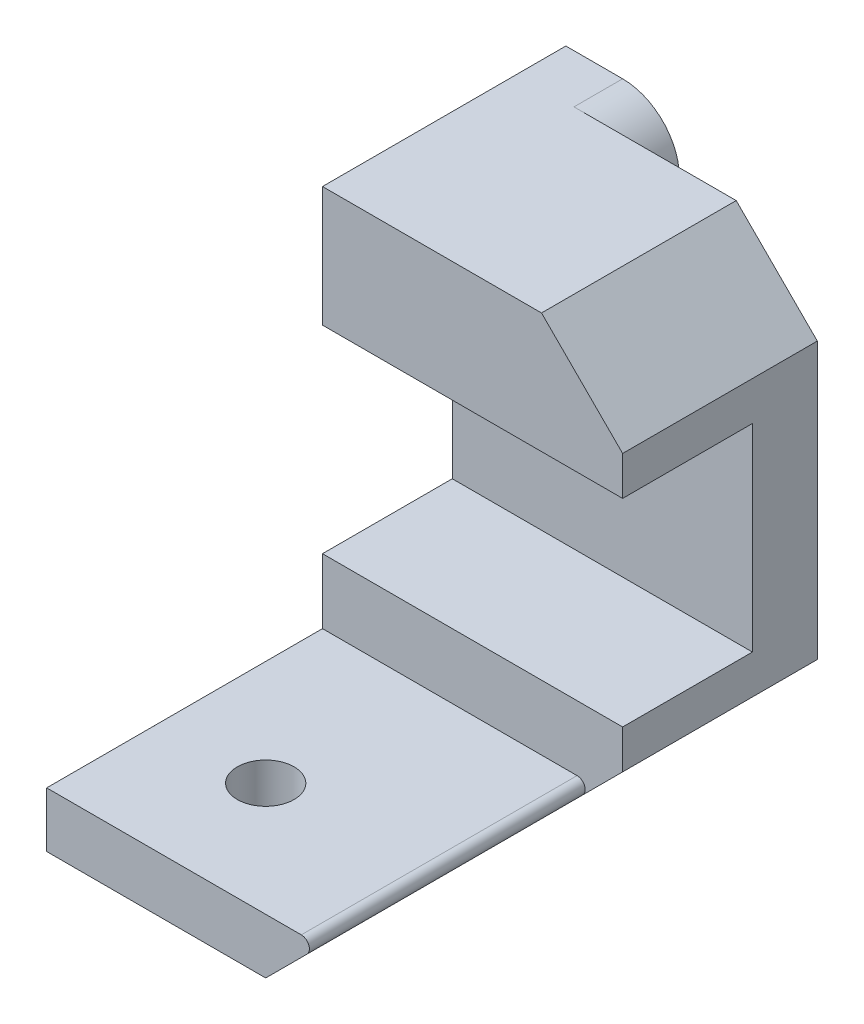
ISO-10303-21;
HEADER;
FILE_DESCRIPTION(('STEP AP214'),'2;1');
FILE_NAME('part.step','',(''),(''),'','','');
FILE_SCHEMA(('AUTOMOTIVE_DESIGN { 1 0 10303 214 1 1 1 1 }'));
ENDSEC;
DATA;
#1=APPLICATION_CONTEXT('core data for automotive mechanical design processes');
#2=APPLICATION_PROTOCOL_DEFINITION('international standard','automotive_design',2000,#1);
#3=PRODUCT_CONTEXT('',#1,'mechanical');
#4=PRODUCT('Part','Part','',(#3));
#5=PRODUCT_RELATED_PRODUCT_CATEGORY('part','',(#4));
#6=PRODUCT_DEFINITION_FORMATION('','',#4);
#7=PRODUCT_DEFINITION_CONTEXT('part definition',#1,'design');
#8=PRODUCT_DEFINITION('design','',#6,#7);
#9=PRODUCT_DEFINITION_SHAPE('','',#8);
#10=(LENGTH_UNIT() NAMED_UNIT(*) SI_UNIT(.MILLI.,.METRE.));
#11=(NAMED_UNIT(*) PLANE_ANGLE_UNIT() SI_UNIT($,.RADIAN.));
#12=(NAMED_UNIT(*) SI_UNIT($,.STERADIAN.) SOLID_ANGLE_UNIT());
#13=UNCERTAINTY_MEASURE_WITH_UNIT(LENGTH_MEASURE(1.E-05),#10,'distance_accuracy_value','');
#14=(GEOMETRIC_REPRESENTATION_CONTEXT(3) GLOBAL_UNCERTAINTY_ASSIGNED_CONTEXT((#13)) GLOBAL_UNIT_ASSIGNED_CONTEXT((#10,
#11,#12)) REPRESENTATION_CONTEXT('',''));
#15=CARTESIAN_POINT('',(0.,0.,0.));
#16=DIRECTION('',(0.,0.,1.));
#17=DIRECTION('',(1.,0.,0.));
#18=AXIS2_PLACEMENT_3D('',#15,#16,#17);
#19=CARTESIAN_POINT('',(-5.75,-10.,15.));
#20=DIRECTION('',(0.,0.,1.));
#21=DIRECTION('',(-1.,0.,0.));
#22=AXIS2_PLACEMENT_3D('',#19,#20,#21);
#23=CYLINDRICAL_SURFACE('',#22,3.5);
#24=CARTESIAN_POINT('',(-5.75,-10.,15.));
#25=DIRECTION('',(0.,0.,1.));
#26=DIRECTION('',(1.,0.,0.));
#27=AXIS2_PLACEMENT_3D('',#24,#25,#26);
#28=CIRCLE('',#27,3.5);
#29=CARTESIAN_POINT('',(-5.75,-13.5,15.));
#30=VERTEX_POINT('',#29);
#31=CARTESIAN_POINT('',(-5.75,-6.5,15.));
#32=VERTEX_POINT('',#31);
#33=EDGE_CURVE('E294',#30,#32,#28,.T.);
#34=ORIENTED_EDGE('',*,*,#33,.T.);
#35=DIRECTION('',(0.,0.,-1.));
#36=VECTOR('',#35,1.);
#37=CARTESIAN_POINT('',(-5.75,-6.5,22.9497474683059));
#38=LINE('',#37,#36);
#39=CARTESIAN_POINT('',(-5.75,-6.5,18.));
#40=VERTEX_POINT('',#39);
#41=EDGE_CURVE('E238',#40,#32,#38,.T.);
#42=ORIENTED_EDGE('',*,*,#41,.F.);
#43=CARTESIAN_POINT('',(-5.75,-10.,18.));
#44=DIRECTION('',(0.,0.,-1.));
#45=DIRECTION('',(-1.,0.,0.));
#46=AXIS2_PLACEMENT_3D('',#43,#44,#45);
#47=CIRCLE('',#46,3.5);
#48=CARTESIAN_POINT('',(-5.74999999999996,-13.5,18.));
#49=VERTEX_POINT('',#48);
#50=EDGE_CURVE('E305',#49,#40,#47,.F.);
#51=ORIENTED_EDGE('',*,*,#50,.F.);
#52=DIRECTION('',(0.,0.,-1.));
#53=VECTOR('',#52,1.);
#54=CARTESIAN_POINT('',(-5.74999999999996,-13.5,22.9497474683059));
#55=LINE('',#54,#53);
#56=EDGE_CURVE('E228',#49,#30,#55,.T.);
#57=ORIENTED_EDGE('',*,*,#56,.T.);
#58=EDGE_LOOP('',(#34,#42,#51,#57));
#59=FACE_BOUND('',#58,.T.);
#60=ADVANCED_FACE('F43',(#59),#23,.T.);
#61=CARTESIAN_POINT('',(-5.75,10.,15.));
#62=DIRECTION('',(0.,0.,1.));
#63=DIRECTION('',(-1.,0.,0.));
#64=AXIS2_PLACEMENT_3D('',#61,#62,#63);
#65=CYLINDRICAL_SURFACE('',#64,3.5);
#66=DIRECTION('',(0.,0.,-1.));
#67=VECTOR('',#66,1.);
#68=CARTESIAN_POINT('',(-5.75,13.5,22.9497474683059));
#69=LINE('',#68,#67);
#70=CARTESIAN_POINT('',(-5.75,13.5,18.));
#71=VERTEX_POINT('',#70);
#72=CARTESIAN_POINT('',(-5.75,13.5,15.));
#73=VERTEX_POINT('',#72);
#74=EDGE_CURVE('E254',#71,#73,#69,.T.);
#75=ORIENTED_EDGE('',*,*,#74,.F.);
#76=CARTESIAN_POINT('',(-5.75,10.,18.));
#77=DIRECTION('',(0.,0.,1.));
#78=DIRECTION('',(1.,0.,0.));
#79=AXIS2_PLACEMENT_3D('',#76,#77,#78);
#80=CIRCLE('',#79,3.5);
#81=CARTESIAN_POINT('',(-5.75,6.5,18.));
#82=VERTEX_POINT('',#81);
#83=EDGE_CURVE('E301',#82,#71,#80,.T.);
#84=ORIENTED_EDGE('',*,*,#83,.F.);
#85=DIRECTION('',(0.,0.,-1.));
#86=VECTOR('',#85,1.);
#87=CARTESIAN_POINT('',(-5.75,6.5,22.9497474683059));
#88=LINE('',#87,#86);
#89=CARTESIAN_POINT('',(-5.75,6.5,15.));
#90=VERTEX_POINT('',#89);
#91=EDGE_CURVE('E265',#82,#90,#88,.T.);
#92=ORIENTED_EDGE('',*,*,#91,.T.);
#93=CARTESIAN_POINT('',(-5.75,10.,15.));
#94=DIRECTION('',(0.,0.,1.));
#95=DIRECTION('',(1.,0.,0.));
#96=AXIS2_PLACEMENT_3D('',#93,#94,#95);
#97=CIRCLE('',#96,3.5);
#98=EDGE_CURVE('E195',#90,#73,#97,.T.);
#99=ORIENTED_EDGE('',*,*,#98,.T.);
#100=EDGE_LOOP('',(#75,#84,#92,#99));
#101=FACE_BOUND('',#100,.T.);
#102=ADVANCED_FACE('F467',(#101),#65,.T.);
#103=CARTESIAN_POINT('',(0.,0.,18.));
#104=DIRECTION('',(0.,0.,1.));
#105=DIRECTION('',(-1.,0.,0.));
#106=AXIS2_PLACEMENT_3D('',#103,#104,#105);
#107=PLANE('',#106);
#108=DIRECTION('',(0.,-1.,0.));
#109=VECTOR('',#108,1.);
#110=CARTESIAN_POINT('',(-9.25,-13.5,18.));
#111=LINE('',#110,#109);
#112=CARTESIAN_POINT('',(-9.25,6.5,18.));
#113=VERTEX_POINT('',#112);
#114=CARTESIAN_POINT('',(-9.25,-6.5,18.));
#115=VERTEX_POINT('',#114);
#116=EDGE_CURVE('E340',#113,#115,#111,.T.);
#117=ORIENTED_EDGE('',*,*,#116,.F.);
#118=DIRECTION('',(-1.,0.,0.));
#119=VECTOR('',#118,1.);
#120=CARTESIAN_POINT('',(0.,6.5,18.));
#121=LINE('',#120,#119);
#122=EDGE_CURVE('E264',#82,#113,#121,.T.);
#123=ORIENTED_EDGE('',*,*,#122,.F.);
#124=ORIENTED_EDGE('',*,*,#83,.T.);
#125=DIRECTION('',(-1.,0.,0.));
#126=VECTOR('',#125,1.);
#127=CARTESIAN_POINT('',(-9.25,13.5,18.));
#128=LINE('',#127,#126);
#129=CARTESIAN_POINT('',(4.25,13.5,18.));
#130=VERTEX_POINT('',#129);
#131=EDGE_CURVE('E336',#130,#71,#128,.T.);
#132=ORIENTED_EDGE('',*,*,#131,.F.);
#133=DIRECTION('',(0.707106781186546,-0.707106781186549,0.));
#134=VECTOR('',#133,1.);
#135=CARTESIAN_POINT('',(4.25,13.5,18.));
#136=LINE('',#135,#134);
#137=CARTESIAN_POINT('',(9.25,8.49999999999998,18.));
#138=VERTEX_POINT('',#137);
#139=EDGE_CURVE('E377',#138,#130,#136,.F.);
#140=ORIENTED_EDGE('',*,*,#139,.F.);
#141=DIRECTION('',(0.,1.,0.));
#142=VECTOR('',#141,1.);
#143=CARTESIAN_POINT('',(9.25,-13.5,18.));
#144=LINE('',#143,#142);
#145=CARTESIAN_POINT('',(9.25,-8.5,18.));
#146=VERTEX_POINT('',#145);
#147=EDGE_CURVE('E332',#146,#138,#144,.T.);
#148=ORIENTED_EDGE('',*,*,#147,.F.);
#149=DIRECTION('',(-0.707106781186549,-0.707106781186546,0.));
#150=VECTOR('',#149,1.);
#151=CARTESIAN_POINT('',(9.25,-8.5,18.));
#152=LINE('',#151,#150);
#153=CARTESIAN_POINT('',(4.24999999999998,-13.5,18.));
#154=VERTEX_POINT('',#153);
#155=EDGE_CURVE('E381',#154,#146,#152,.F.);
#156=ORIENTED_EDGE('',*,*,#155,.F.);
#157=DIRECTION('',(1.,0.,0.));
#158=VECTOR('',#157,1.);
#159=CARTESIAN_POINT('',(-9.25,-13.5,18.));
#160=LINE('',#159,#158);
#161=EDGE_CURVE('E344',#49,#154,#160,.T.);
#162=ORIENTED_EDGE('',*,*,#161,.F.);
#163=ORIENTED_EDGE('',*,*,#50,.T.);
#164=DIRECTION('',(-1.,0.,0.));
#165=VECTOR('',#164,1.);
#166=CARTESIAN_POINT('',(0.,-6.5,18.));
#167=LINE('',#166,#165);
#168=EDGE_CURVE('E242',#40,#115,#167,.T.);
#169=ORIENTED_EDGE('',*,*,#168,.T.);
#170=EDGE_LOOP('',(#117,#123,#124,#132,#140,#148,#156,#162,#163,#169));
#171=FACE_BOUND('',#170,.T.);
#172=ADVANCED_FACE('F436',(#171),#107,.F.);
#173=CARTESIAN_POINT('',(0.,0.,30.));
#174=DIRECTION('',(0.,0.,1.));
#175=DIRECTION('',(-1.,0.,0.));
#176=AXIS2_PLACEMENT_3D('',#173,#174,#175);
#177=PLANE('',#176);
#178=DIRECTION('',(-1.,0.,0.));
#179=VECTOR('',#178,1.);
#180=CARTESIAN_POINT('',(-9.25,13.5,30.));
#181=LINE('',#180,#179);
#182=CARTESIAN_POINT('',(4.25,13.5,30.));
#183=VERTEX_POINT('',#182);
#184=CARTESIAN_POINT('',(-9.25,13.5,30.));
#185=VERTEX_POINT('',#184);
#186=EDGE_CURVE('E352',#183,#185,#181,.T.);
#187=ORIENTED_EDGE('',*,*,#186,.T.);
#188=DIRECTION('',(0.,-1.,0.));
#189=VECTOR('',#188,1.);
#190=CARTESIAN_POINT('',(-9.25,-13.5,30.));
#191=LINE('',#190,#189);
#192=CARTESIAN_POINT('',(-9.25,6.1,30.));
#193=VERTEX_POINT('',#192);
#194=EDGE_CURVE('E337',#185,#193,#191,.T.);
#195=ORIENTED_EDGE('',*,*,#194,.T.);
#196=DIRECTION('',(-1.,0.,0.));
#197=VECTOR('',#196,1.);
#198=CARTESIAN_POINT('',(9.25,6.1,30.));
#199=LINE('',#198,#197);
#200=CARTESIAN_POINT('',(9.25,6.1,30.));
#201=VERTEX_POINT('',#200);
#202=EDGE_CURVE('E322',#201,#193,#199,.T.);
#203=ORIENTED_EDGE('',*,*,#202,.F.);
#204=DIRECTION('',(0.,1.,0.));
#205=VECTOR('',#204,1.);
#206=CARTESIAN_POINT('',(9.25,-13.5,30.));
#207=LINE('',#206,#205);
#208=CARTESIAN_POINT('',(9.25,8.49999999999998,30.));
#209=VERTEX_POINT('',#208);
#210=EDGE_CURVE('E326',#201,#209,#207,.T.);
#211=ORIENTED_EDGE('',*,*,#210,.T.);
#212=DIRECTION('',(-0.707106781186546,0.707106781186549,0.));
#213=VECTOR('',#212,1.);
#214=CARTESIAN_POINT('',(8.87500000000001,8.87499999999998,30.));
#215=LINE('',#214,#213);
#216=EDGE_CURVE('E388',#183,#209,#215,.F.);
#217=ORIENTED_EDGE('',*,*,#216,.F.);
#218=EDGE_LOOP('',(#187,#195,#203,#211,#217));
#219=FACE_BOUND('',#218,.T.);
#220=ADVANCED_FACE('F420',(#219),#177,.T.);
#221=CARTESIAN_POINT('',(9.25,-13.5,18.));
#222=DIRECTION('',(-1.,0.,0.));
#223=DIRECTION('',(0.,0.,-1.));
#224=AXIS2_PLACEMENT_3D('',#221,#222,#223);
#225=PLANE('',#224);
#226=DIRECTION('',(0.,0.,1.));
#227=VECTOR('',#226,1.);
#228=CARTESIAN_POINT('',(9.25,-8.5,18.));
#229=LINE('',#228,#227);
#230=CARTESIAN_POINT('',(9.25,-8.5,30.));
#231=VERTEX_POINT('',#230);
#232=EDGE_CURVE('E370',#146,#231,#229,.T.);
#233=ORIENTED_EDGE('',*,*,#232,.F.);
#234=ORIENTED_EDGE('',*,*,#147,.T.);
#235=DIRECTION('',(0.,0.,-1.));
#236=VECTOR('',#235,1.);
#237=CARTESIAN_POINT('',(9.25,8.49999999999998,18.));
#238=LINE('',#237,#236);
#239=EDGE_CURVE('E367',#209,#138,#238,.T.);
#240=ORIENTED_EDGE('',*,*,#239,.F.);
#241=ORIENTED_EDGE('',*,*,#210,.F.);
#242=DIRECTION('',(0.,0.,1.));
#243=VECTOR('',#242,1.);
#244=CARTESIAN_POINT('',(9.25,6.1,30.));
#245=LINE('',#244,#243);
#246=CARTESIAN_POINT('',(9.25,6.1,22.));
#247=VERTEX_POINT('',#246);
#248=EDGE_CURVE('E315',#247,#201,#245,.T.);
#249=ORIENTED_EDGE('',*,*,#248,.F.);
#250=DIRECTION('',(0.,1.,0.));
#251=VECTOR('',#250,1.);
#252=CARTESIAN_POINT('',(9.25,6.1,22.));
#253=LINE('',#252,#251);
#254=CARTESIAN_POINT('',(9.25,-6.1,22.));
#255=VERTEX_POINT('',#254);
#256=EDGE_CURVE('E310',#255,#247,#253,.T.);
#257=ORIENTED_EDGE('',*,*,#256,.F.);
#258=DIRECTION('',(0.,0.,-1.));
#259=VECTOR('',#258,1.);
#260=CARTESIAN_POINT('',(9.25,-6.1,30.));
#261=LINE('',#260,#259);
#262=CARTESIAN_POINT('',(9.25,-6.1,30.));
#263=VERTEX_POINT('',#262);
#264=EDGE_CURVE('E307',#263,#255,#261,.T.);
#265=ORIENTED_EDGE('',*,*,#264,.F.);
#266=DIRECTION('',(0.,-1.,0.));
#267=VECTOR('',#266,1.);
#268=CARTESIAN_POINT('',(9.25,-6.1,30.));
#269=LINE('',#268,#267);
#270=EDGE_CURVE('E178',#263,#231,#269,.T.);
#271=ORIENTED_EDGE('',*,*,#270,.T.);
#272=EDGE_LOOP('',(#233,#234,#240,#241,#249,#257,#265,#271));
#273=FACE_BOUND('',#272,.T.);
#274=ADVANCED_FACE('F407',(#273),#225,.F.);
#275=CARTESIAN_POINT('',(-9.25,13.5,18.));
#276=DIRECTION('',(0.,-1.,0.));
#277=DIRECTION('',(0.,0.,1.));
#278=AXIS2_PLACEMENT_3D('',#275,#276,#277);
#279=PLANE('',#278);
#280=ORIENTED_EDGE('',*,*,#131,.T.);
#281=ORIENTED_EDGE('',*,*,#74,.T.);
#282=DIRECTION('',(1.,0.,0.));
#283=VECTOR('',#282,1.);
#284=CARTESIAN_POINT('',(0.,13.5,15.));
#285=LINE('',#284,#283);
#286=CARTESIAN_POINT('',(-9.25,13.5,15.));
#287=VERTEX_POINT('',#286);
#288=EDGE_CURVE('E250',#287,#73,#285,.T.);
#289=ORIENTED_EDGE('',*,*,#288,.F.);
#290=DIRECTION('',(0.,0.,1.));
#291=VECTOR('',#290,1.);
#292=CARTESIAN_POINT('',(-9.25,13.5,18.));
#293=LINE('',#292,#291);
#294=EDGE_CURVE('E306',#287,#185,#293,.T.);
#295=ORIENTED_EDGE('',*,*,#294,.T.);
#296=ORIENTED_EDGE('',*,*,#186,.F.);
#297=DIRECTION('',(0.,0.,1.));
#298=VECTOR('',#297,1.);
#299=CARTESIAN_POINT('',(4.25,13.5,18.));
#300=LINE('',#299,#298);
#301=EDGE_CURVE('E385',#130,#183,#300,.T.);
#302=ORIENTED_EDGE('',*,*,#301,.F.);
#303=EDGE_LOOP('',(#280,#281,#289,#295,#296,#302));
#304=FACE_BOUND('',#303,.T.);
#305=ADVANCED_FACE('F424',(#304),#279,.F.);
#306=CARTESIAN_POINT('',(-9.25,-13.5,18.));
#307=DIRECTION('',(1.,0.,0.));
#308=DIRECTION('',(0.,0.,1.));
#309=AXIS2_PLACEMENT_3D('',#306,#307,#308);
#310=PLANE('',#309);
#311=DIRECTION('',(0.,-1.,0.));
#312=VECTOR('',#311,1.);
#313=CARTESIAN_POINT('',(-9.25,-6.1,30.));
#314=LINE('',#313,#312);
#315=CARTESIAN_POINT('',(-9.25,-6.1,30.));
#316=VERTEX_POINT('',#315);
#317=CARTESIAN_POINT('',(-9.25,-10.1,30.));
#318=VERTEX_POINT('',#317);
#319=EDGE_CURVE('E176',#316,#318,#314,.T.);
#320=ORIENTED_EDGE('',*,*,#319,.F.);
#321=DIRECTION('',(0.,0.,-1.));
#322=VECTOR('',#321,1.);
#323=CARTESIAN_POINT('',(-9.25,-6.1,30.));
#324=LINE('',#323,#322);
#325=CARTESIAN_POINT('',(-9.25,-6.1,22.));
#326=VERTEX_POINT('',#325);
#327=EDGE_CURVE('E187',#316,#326,#324,.T.);
#328=ORIENTED_EDGE('',*,*,#327,.T.);
#329=DIRECTION('',(0.,1.,0.));
#330=VECTOR('',#329,1.);
#331=CARTESIAN_POINT('',(-9.25,6.1,22.));
#332=LINE('',#331,#330);
#333=CARTESIAN_POINT('',(-9.25,6.1,22.));
#334=VERTEX_POINT('',#333);
#335=EDGE_CURVE('E194',#326,#334,#332,.T.);
#336=ORIENTED_EDGE('',*,*,#335,.T.);
#337=DIRECTION('',(0.,0.,1.));
#338=VECTOR('',#337,1.);
#339=CARTESIAN_POINT('',(-9.25,6.1,30.));
#340=LINE('',#339,#338);
#341=EDGE_CURVE('E311',#334,#193,#340,.T.);
#342=ORIENTED_EDGE('',*,*,#341,.T.);
#343=ORIENTED_EDGE('',*,*,#194,.F.);
#344=ORIENTED_EDGE('',*,*,#294,.F.);
#345=DIRECTION('',(0.,1.,0.));
#346=VECTOR('',#345,1.);
#347=CARTESIAN_POINT('',(-9.25,0.,15.));
#348=LINE('',#347,#346);
#349=CARTESIAN_POINT('',(-9.25,6.5,15.));
#350=VERTEX_POINT('',#349);
#351=EDGE_CURVE('E266',#350,#287,#348,.T.);
#352=ORIENTED_EDGE('',*,*,#351,.F.);
#353=DIRECTION('',(0.,0.,-1.));
#354=VECTOR('',#353,1.);
#355=CARTESIAN_POINT('',(-9.25,6.5,22.9497474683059));
#356=LINE('',#355,#354);
#357=EDGE_CURVE('E258',#113,#350,#356,.T.);
#358=ORIENTED_EDGE('',*,*,#357,.F.);
#359=ORIENTED_EDGE('',*,*,#116,.T.);
#360=DIRECTION('',(0.,0.,-1.));
#361=VECTOR('',#360,1.);
#362=CARTESIAN_POINT('',(-9.25,-6.5,22.9497474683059));
#363=LINE('',#362,#361);
#364=CARTESIAN_POINT('',(-9.25,-6.5,15.));
#365=VERTEX_POINT('',#364);
#366=EDGE_CURVE('E246',#115,#365,#363,.T.);
#367=ORIENTED_EDGE('',*,*,#366,.T.);
#368=DIRECTION('',(0.,-1.,0.));
#369=VECTOR('',#368,1.);
#370=CARTESIAN_POINT('',(-9.25,0.,15.));
#371=LINE('',#370,#369);
#372=CARTESIAN_POINT('',(-9.25,-13.5,15.));
#373=VERTEX_POINT('',#372);
#374=EDGE_CURVE('E232',#365,#373,#371,.T.);
#375=ORIENTED_EDGE('',*,*,#374,.T.);
#376=DIRECTION('',(0.,0.,1.));
#377=VECTOR('',#376,1.);
#378=CARTESIAN_POINT('',(-9.25,-13.5,18.));
#379=LINE('',#378,#377);
#380=CARTESIAN_POINT('',(-9.25,-13.5,47.));
#381=VERTEX_POINT('',#380);
#382=EDGE_CURVE('E348',#373,#381,#379,.T.);
#383=ORIENTED_EDGE('',*,*,#382,.T.);
#384=DIRECTION('',(0.,1.,0.));
#385=VECTOR('',#384,1.);
#386=CARTESIAN_POINT('',(-9.25,-13.5,47.));
#387=LINE('',#386,#385);
#388=CARTESIAN_POINT('',(-9.25,-10.1,47.));
#389=VERTEX_POINT('',#388);
#390=EDGE_CURVE('E224',#381,#389,#387,.T.);
#391=ORIENTED_EDGE('',*,*,#390,.T.);
#392=DIRECTION('',(0.,0.,1.));
#393=VECTOR('',#392,1.);
#394=CARTESIAN_POINT('',(-9.25,-10.1,47.));
#395=LINE('',#394,#393);
#396=EDGE_CURVE('E184',#318,#389,#395,.T.);
#397=ORIENTED_EDGE('',*,*,#396,.F.);
#398=EDGE_LOOP('',(#320,#328,#336,#342,#343,#344,#352,#358,#359,#367,#375,#383,#391,#397));
#399=FACE_BOUND('',#398,.T.);
#400=ADVANCED_FACE('F198',(#399),#310,.F.);
#401=CARTESIAN_POINT('',(-9.25,-13.5,18.));
#402=DIRECTION('',(0.,1.,0.));
#403=DIRECTION('',(0.,0.,-1.));
#404=AXIS2_PLACEMENT_3D('',#401,#402,#403);
#405=PLANE('',#404);
#406=CARTESIAN_POINT('',(-2.75,-13.5,40.));
#407=DIRECTION('',(0.,1.,0.));
#408=DIRECTION('',(0.,0.,1.));
#409=AXIS2_PLACEMENT_3D('',#406,#407,#408);
#410=CIRCLE('',#409,1.74999999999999);
#411=CARTESIAN_POINT('',(-2.75,-13.5,41.75));
#412=VERTEX_POINT('',#411);
#413=EDGE_CURVE('E800',#412,#412,#410,.T.);
#414=ORIENTED_EDGE('',*,*,#413,.T.);
#415=EDGE_LOOP('',(#414));
#416=FACE_BOUND('',#415,.T.);
#417=ORIENTED_EDGE('',*,*,#382,.F.);
#418=DIRECTION('',(1.,0.,0.));
#419=VECTOR('',#418,1.);
#420=CARTESIAN_POINT('',(0.,-13.5,15.));
#421=LINE('',#420,#419);
#422=EDGE_CURVE('E227',#373,#30,#421,.T.);
#423=ORIENTED_EDGE('',*,*,#422,.T.);
#424=ORIENTED_EDGE('',*,*,#56,.F.);
#425=ORIENTED_EDGE('',*,*,#161,.T.);
#426=DIRECTION('',(0.,0.,-1.));
#427=VECTOR('',#426,1.);
#428=CARTESIAN_POINT('',(4.24999999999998,-13.5,18.));
#429=LINE('',#428,#427);
#430=CARTESIAN_POINT('',(4.24999999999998,-13.5,47.));
#431=VERTEX_POINT('',#430);
#432=EDGE_CURVE('E374',#431,#154,#429,.T.);
#433=ORIENTED_EDGE('',*,*,#432,.F.);
#434=DIRECTION('',(-1.,0.,0.));
#435=VECTOR('',#434,1.);
#436=CARTESIAN_POINT('',(4.24999999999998,-13.5,47.));
#437=LINE('',#436,#435);
#438=EDGE_CURVE('E221',#431,#381,#437,.T.);
#439=ORIENTED_EDGE('',*,*,#438,.T.);
#440=EDGE_LOOP('',(#417,#423,#424,#425,#433,#439));
#441=FACE_BOUND('',#440,.T.);
#442=ADVANCED_FACE('F447',(#416,#441),#405,.F.);
#443=CARTESIAN_POINT('',(9.25,6.1,30.));
#444=DIRECTION('',(0.,1.,0.));
#445=DIRECTION('',(0.,0.,-1.));
#446=AXIS2_PLACEMENT_3D('',#443,#444,#445);
#447=PLANE('',#446);
#448=ORIENTED_EDGE('',*,*,#341,.F.);
#449=DIRECTION('',(-1.,0.,0.));
#450=VECTOR('',#449,1.);
#451=CARTESIAN_POINT('',(9.25,6.1,22.));
#452=LINE('',#451,#450);
#453=EDGE_CURVE('E327',#247,#334,#452,.T.);
#454=ORIENTED_EDGE('',*,*,#453,.F.);
#455=ORIENTED_EDGE('',*,*,#248,.T.);
#456=ORIENTED_EDGE('',*,*,#202,.T.);
#457=EDGE_LOOP('',(#448,#454,#455,#456));
#458=FACE_BOUND('',#457,.T.);
#459=ADVANCED_FACE('F418',(#458),#447,.F.);
#460=CARTESIAN_POINT('',(9.25,6.1,22.));
#461=DIRECTION('',(0.,0.,-1.));
#462=DIRECTION('',(0.,-1.,0.));
#463=AXIS2_PLACEMENT_3D('',#460,#461,#462);
#464=PLANE('',#463);
#465=ORIENTED_EDGE('',*,*,#335,.F.);
#466=DIRECTION('',(-1.,0.,0.));
#467=VECTOR('',#466,1.);
#468=CARTESIAN_POINT('',(9.25,-6.1,22.));
#469=LINE('',#468,#467);
#470=EDGE_CURVE('E189',#255,#326,#469,.T.);
#471=ORIENTED_EDGE('',*,*,#470,.F.);
#472=ORIENTED_EDGE('',*,*,#256,.T.);
#473=ORIENTED_EDGE('',*,*,#453,.T.);
#474=EDGE_LOOP('',(#465,#471,#472,#473));
#475=FACE_BOUND('',#474,.T.);
#476=ADVANCED_FACE('F412',(#475),#464,.F.);
#477=CARTESIAN_POINT('',(9.25,-6.1,30.));
#478=DIRECTION('',(0.,-1.,0.));
#479=DIRECTION('',(0.,0.,1.));
#480=AXIS2_PLACEMENT_3D('',#477,#478,#479);
#481=PLANE('',#480);
#482=ORIENTED_EDGE('',*,*,#264,.T.);
#483=ORIENTED_EDGE('',*,*,#470,.T.);
#484=ORIENTED_EDGE('',*,*,#327,.F.);
#485=DIRECTION('',(1.,0.,0.));
#486=VECTOR('',#485,1.);
#487=CARTESIAN_POINT('',(-9.25,-6.1,30.));
#488=LINE('',#487,#486);
#489=EDGE_CURVE('E172',#316,#263,#488,.T.);
#490=ORIENTED_EDGE('',*,*,#489,.T.);
#491=EDGE_LOOP('',(#482,#483,#484,#490));
#492=FACE_BOUND('',#491,.T.);
#493=ADVANCED_FACE('F188',(#492),#481,.F.);
#494=CARTESIAN_POINT('',(-5.75,10.,15.));
#495=DIRECTION('',(0.,0.,-1.));
#496=DIRECTION('',(1.,0.,0.));
#497=AXIS2_PLACEMENT_3D('',#494,#495,#496);
#498=PLANE('',#497);
#499=CARTESIAN_POINT('',(-5.75,10.,15.));
#500=DIRECTION('',(0.,0.,1.));
#501=DIRECTION('',(1.,0.,0.));
#502=AXIS2_PLACEMENT_3D('',#499,#500,#501);
#503=CIRCLE('',#502,1.99999999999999);
#504=CARTESIAN_POINT('',(-3.75000000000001,10.,15.));
#505=VERTEX_POINT('',#504);
#506=EDGE_CURVE('E272',#505,#505,#503,.T.);
#507=ORIENTED_EDGE('',*,*,#506,.T.);
#508=EDGE_LOOP('',(#507));
#509=FACE_BOUND('',#508,.T.);
#510=ORIENTED_EDGE('',*,*,#98,.F.);
#511=DIRECTION('',(-1.,0.,0.));
#512=VECTOR('',#511,1.);
#513=CARTESIAN_POINT('',(0.,6.5,15.));
#514=LINE('',#513,#512);
#515=EDGE_CURVE('E261',#90,#350,#514,.T.);
#516=ORIENTED_EDGE('',*,*,#515,.T.);
#517=ORIENTED_EDGE('',*,*,#351,.T.);
#518=ORIENTED_EDGE('',*,*,#288,.T.);
#519=EDGE_LOOP('',(#510,#516,#517,#518));
#520=FACE_BOUND('',#519,.T.);
#521=ADVANCED_FACE('F429',(#509,#520),#498,.T.);
#522=CARTESIAN_POINT('',(-5.75,-10.,15.));
#523=DIRECTION('',(0.,0.,-1.));
#524=DIRECTION('',(1.,0.,0.));
#525=AXIS2_PLACEMENT_3D('',#522,#523,#524);
#526=PLANE('',#525);
#527=CARTESIAN_POINT('',(-5.75,-10.,15.));
#528=DIRECTION('',(0.,0.,1.));
#529=DIRECTION('',(1.,0.,0.));
#530=AXIS2_PLACEMENT_3D('',#527,#528,#529);
#531=CIRCLE('',#530,1.99999999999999);
#532=CARTESIAN_POINT('',(-3.75000000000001,-10.,15.));
#533=VERTEX_POINT('',#532);
#534=EDGE_CURVE('E286',#533,#533,#531,.T.);
#535=ORIENTED_EDGE('',*,*,#534,.T.);
#536=EDGE_LOOP('',(#535));
#537=FACE_BOUND('',#536,.T.);
#538=ORIENTED_EDGE('',*,*,#374,.F.);
#539=DIRECTION('',(-1.,0.,0.));
#540=VECTOR('',#539,1.);
#541=CARTESIAN_POINT('',(0.,-6.5,15.));
#542=LINE('',#541,#540);
#543=EDGE_CURVE('E235',#32,#365,#542,.T.);
#544=ORIENTED_EDGE('',*,*,#543,.F.);
#545=ORIENTED_EDGE('',*,*,#33,.F.);
#546=ORIENTED_EDGE('',*,*,#422,.F.);
#547=EDGE_LOOP('',(#538,#544,#545,#546));
#548=FACE_BOUND('',#547,.T.);
#549=ADVANCED_FACE('F443',(#537,#548),#526,.T.);
#550=CARTESIAN_POINT('',(-5.75,-10.,21.5));
#551=DIRECTION('',(0.,0.,1.));
#552=DIRECTION('',(-1.,0.,0.));
#553=AXIS2_PLACEMENT_3D('',#550,#551,#552);
#554=PLANE('',#553);
#555=CARTESIAN_POINT('',(-5.75,-10.,21.5));
#556=DIRECTION('',(0.,0.,1.));
#557=DIRECTION('',(1.,0.,0.));
#558=AXIS2_PLACEMENT_3D('',#555,#556,#557);
#559=CIRCLE('',#558,2.);
#560=CARTESIAN_POINT('',(-3.75,-10.,21.5));
#561=VERTEX_POINT('',#560);
#562=EDGE_CURVE('E290',#561,#561,#559,.T.);
#563=ORIENTED_EDGE('',*,*,#562,.F.);
#564=EDGE_LOOP('',(#563));
#565=FACE_BOUND('',#564,.T.);
#566=ADVANCED_FACE('F529',(#565),#554,.F.);
#567=CARTESIAN_POINT('',(-5.75,-10.,15.));
#568=DIRECTION('',(0.,0.,-1.));
#569=DIRECTION('',(1.,0.,0.));
#570=AXIS2_PLACEMENT_3D('',#567,#568,#569);
#571=CYLINDRICAL_SURFACE('',#570,1.99999999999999);
#572=ORIENTED_EDGE('',*,*,#562,.T.);
#573=EDGE_LOOP('',(#572));
#574=FACE_BOUND('',#573,.T.);
#575=ORIENTED_EDGE('',*,*,#534,.F.);
#576=EDGE_LOOP('',(#575));
#577=FACE_BOUND('',#576,.T.);
#578=ADVANCED_FACE('F526',(#574,#577),#571,.F.);
#579=CARTESIAN_POINT('',(-5.75,10.,21.5));
#580=DIRECTION('',(0.,0.,1.));
#581=DIRECTION('',(-1.,0.,0.));
#582=AXIS2_PLACEMENT_3D('',#579,#580,#581);
#583=PLANE('',#582);
#584=CARTESIAN_POINT('',(-5.75,10.,21.5));
#585=DIRECTION('',(0.,0.,1.));
#586=DIRECTION('',(1.,0.,0.));
#587=AXIS2_PLACEMENT_3D('',#584,#585,#586);
#588=CIRCLE('',#587,2.);
#589=CARTESIAN_POINT('',(-3.75,10.,21.5));
#590=VERTEX_POINT('',#589);
#591=EDGE_CURVE('E282',#590,#590,#588,.T.);
#592=ORIENTED_EDGE('',*,*,#591,.F.);
#593=EDGE_LOOP('',(#592));
#594=FACE_BOUND('',#593,.T.);
#595=ADVANCED_FACE('F522',(#594),#583,.F.);
#596=CARTESIAN_POINT('',(-5.75,10.,15.));
#597=DIRECTION('',(0.,0.,-1.));
#598=DIRECTION('',(1.,0.,0.));
#599=AXIS2_PLACEMENT_3D('',#596,#597,#598);
#600=CYLINDRICAL_SURFACE('',#599,1.99999999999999);
#601=ORIENTED_EDGE('',*,*,#591,.T.);
#602=EDGE_LOOP('',(#601));
#603=FACE_BOUND('',#602,.T.);
#604=ORIENTED_EDGE('',*,*,#506,.F.);
#605=EDGE_LOOP('',(#604));
#606=FACE_BOUND('',#605,.T.);
#607=ADVANCED_FACE('F502',(#603,#606),#600,.F.);
#608=CARTESIAN_POINT('',(9.25,-8.5,18.));
#609=DIRECTION('',(-0.707106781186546,0.707106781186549,0.));
#610=DIRECTION('',(0.,0.,1.));
#611=AXIS2_PLACEMENT_3D('',#608,#609,#610);
#612=PLANE('',#611);
#613=DIRECTION('',(-0.707106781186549,-0.707106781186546,0.));
#614=VECTOR('',#613,1.);
#615=CARTESIAN_POINT('',(9.25,-8.5,47.));
#616=LINE('',#615,#614);
#617=CARTESIAN_POINT('',(6.79644660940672,-10.9535533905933,47.));
#618=VERTEX_POINT('',#617);
#619=EDGE_CURVE('E216',#618,#431,#616,.T.);
#620=ORIENTED_EDGE('',*,*,#619,.T.);
#621=ORIENTED_EDGE('',*,*,#432,.T.);
#622=ORIENTED_EDGE('',*,*,#155,.T.);
#623=ORIENTED_EDGE('',*,*,#232,.T.);
#624=DIRECTION('',(0.707106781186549,0.707106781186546,0.));
#625=VECTOR('',#624,1.);
#626=CARTESIAN_POINT('',(9.25,-8.5,30.));
#627=LINE('',#626,#625);
#628=CARTESIAN_POINT('',(6.79644660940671,-10.9535533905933,30.));
#629=VERTEX_POINT('',#628);
#630=EDGE_CURVE('E392',#231,#629,#627,.F.);
#631=ORIENTED_EDGE('',*,*,#630,.T.);
#632=DIRECTION('',(0.,0.,1.));
#633=VECTOR('',#632,1.);
#634=CARTESIAN_POINT('',(6.79644660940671,-10.9535533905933,30.));
#635=LINE('',#634,#633);
#636=EDGE_CURVE('E52',#618,#629,#635,.F.);
#637=ORIENTED_EDGE('',*,*,#636,.F.);
#638=EDGE_LOOP('',(#620,#621,#622,#623,#631,#637));
#639=FACE_BOUND('',#638,.T.);
#640=ADVANCED_FACE('F405',(#639),#612,.F.);
#641=CARTESIAN_POINT('',(4.25,13.5,18.));
#642=DIRECTION('',(-0.707106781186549,-0.707106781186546,0.));
#643=DIRECTION('',(0.,0.,1.));
#644=AXIS2_PLACEMENT_3D('',#641,#642,#643);
#645=PLANE('',#644);
#646=ORIENTED_EDGE('',*,*,#139,.T.);
#647=ORIENTED_EDGE('',*,*,#301,.T.);
#648=ORIENTED_EDGE('',*,*,#216,.T.);
#649=ORIENTED_EDGE('',*,*,#239,.T.);
#650=EDGE_LOOP('',(#646,#647,#648,#649));
#651=FACE_BOUND('',#650,.T.);
#652=ADVANCED_FACE('F501',(#651),#645,.F.);
#653=CARTESIAN_POINT('',(0.,6.5,22.9497474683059));
#654=DIRECTION('',(0.,1.,0.));
#655=DIRECTION('',(0.,0.,-1.));
#656=AXIS2_PLACEMENT_3D('',#653,#654,#655);
#657=PLANE('',#656);
#658=ORIENTED_EDGE('',*,*,#122,.T.);
#659=ORIENTED_EDGE('',*,*,#357,.T.);
#660=ORIENTED_EDGE('',*,*,#515,.F.);
#661=ORIENTED_EDGE('',*,*,#91,.F.);
#662=EDGE_LOOP('',(#658,#659,#660,#661));
#663=FACE_BOUND('',#662,.T.);
#664=ADVANCED_FACE('F432',(#663),#657,.F.);
#665=CARTESIAN_POINT('',(0.,-6.5,22.9497474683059));
#666=DIRECTION('',(0.,1.,0.));
#667=DIRECTION('',(0.,0.,-1.));
#668=AXIS2_PLACEMENT_3D('',#665,#666,#667);
#669=PLANE('',#668);
#670=ORIENTED_EDGE('',*,*,#41,.T.);
#671=ORIENTED_EDGE('',*,*,#543,.T.);
#672=ORIENTED_EDGE('',*,*,#366,.F.);
#673=ORIENTED_EDGE('',*,*,#168,.F.);
#674=EDGE_LOOP('',(#670,#671,#672,#673));
#675=FACE_BOUND('',#674,.T.);
#676=ADVANCED_FACE('F439',(#675),#669,.T.);
#677=CARTESIAN_POINT('',(0.,0.,47.));
#678=DIRECTION('',(0.,0.,1.));
#679=DIRECTION('',(-1.,0.,0.));
#680=AXIS2_PLACEMENT_3D('',#677,#678,#679);
#681=PLANE('',#680);
#682=DIRECTION('',(1.,0.,0.));
#683=VECTOR('',#682,1.);
#684=CARTESIAN_POINT('',(-9.25,-10.1,47.));
#685=LINE('',#684,#683);
#686=CARTESIAN_POINT('',(6.44289321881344,-10.1,47.));
#687=VERTEX_POINT('',#686);
#688=EDGE_CURVE('E212',#389,#687,#685,.T.);
#689=ORIENTED_EDGE('',*,*,#688,.F.);
#690=ORIENTED_EDGE('',*,*,#390,.F.);
#691=ORIENTED_EDGE('',*,*,#438,.F.);
#692=ORIENTED_EDGE('',*,*,#619,.F.);
#693=CARTESIAN_POINT('',(6.44289321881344,-10.6,47.));
#694=DIRECTION('',(0.,0.,-1.));
#695=DIRECTION('',(-1.,0.,0.));
#696=AXIS2_PLACEMENT_3D('',#693,#694,#695);
#697=CIRCLE('',#696,0.5);
#698=EDGE_CURVE('E64',#687,#618,#697,.T.);
#699=ORIENTED_EDGE('',*,*,#698,.F.);
#700=EDGE_LOOP('',(#689,#690,#691,#692,#699));
#701=FACE_BOUND('',#700,.T.);
#702=ADVANCED_FACE('F452',(#701),#681,.T.);
#703=CARTESIAN_POINT('',(-9.25,-10.1,47.));
#704=DIRECTION('',(0.,-1.,0.));
#705=DIRECTION('',(0.,0.,1.));
#706=AXIS2_PLACEMENT_3D('',#703,#704,#705);
#707=PLANE('',#706);
#708=CARTESIAN_POINT('',(-2.75,-10.1,40.));
#709=DIRECTION('',(0.,1.,0.));
#710=DIRECTION('',(0.,0.,1.));
#711=AXIS2_PLACEMENT_3D('',#708,#709,#710);
#712=CIRCLE('',#711,1.74999999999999);
#713=CARTESIAN_POINT('',(-2.75,-10.1,41.75));
#714=VERTEX_POINT('',#713);
#715=EDGE_CURVE('E207',#714,#714,#712,.T.);
#716=ORIENTED_EDGE('',*,*,#715,.F.);
#717=EDGE_LOOP('',(#716));
#718=FACE_BOUND('',#717,.T.);
#719=DIRECTION('',(1.,0.,0.));
#720=VECTOR('',#719,1.);
#721=CARTESIAN_POINT('',(-9.25,-10.1,30.));
#722=LINE('',#721,#720);
#723=CARTESIAN_POINT('',(6.44289321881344,-10.1,30.));
#724=VERTEX_POINT('',#723);
#725=EDGE_CURVE('E183',#318,#724,#722,.T.);
#726=ORIENTED_EDGE('',*,*,#725,.F.);
#727=ORIENTED_EDGE('',*,*,#396,.T.);
#728=ORIENTED_EDGE('',*,*,#688,.T.);
#729=DIRECTION('',(0.,0.,-1.));
#730=VECTOR('',#729,1.);
#731=CARTESIAN_POINT('',(6.44289321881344,-10.1,47.));
#732=LINE('',#731,#730);
#733=EDGE_CURVE('E396',#724,#687,#732,.F.);
#734=ORIENTED_EDGE('',*,*,#733,.F.);
#735=EDGE_LOOP('',(#726,#727,#728,#734));
#736=FACE_BOUND('',#735,.T.);
#737=ADVANCED_FACE('F454',(#718,#736),#707,.F.);
#738=CARTESIAN_POINT('',(-9.25,-6.1,30.));
#739=DIRECTION('',(0.,0.,-1.));
#740=DIRECTION('',(0.,-1.,0.));
#741=AXIS2_PLACEMENT_3D('',#738,#739,#740);
#742=PLANE('',#741);
#743=ORIENTED_EDGE('',*,*,#630,.F.);
#744=ORIENTED_EDGE('',*,*,#270,.F.);
#745=ORIENTED_EDGE('',*,*,#489,.F.);
#746=ORIENTED_EDGE('',*,*,#319,.T.);
#747=ORIENTED_EDGE('',*,*,#725,.T.);
#748=CARTESIAN_POINT('',(6.44289321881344,-10.6,30.));
#749=DIRECTION('',(0.,0.,1.));
#750=DIRECTION('',(0.,-1.,0.));
#751=AXIS2_PLACEMENT_3D('',#748,#749,#750);
#752=CIRCLE('',#751,0.5);
#753=EDGE_CURVE('E11',#629,#724,#752,.T.);
#754=ORIENTED_EDGE('',*,*,#753,.F.);
#755=EDGE_LOOP('',(#743,#744,#745,#746,#747,#754));
#756=FACE_BOUND('',#755,.T.);
#757=ADVANCED_FACE('F174',(#756),#742,.F.);
#758=CARTESIAN_POINT('',(6.44289321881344,-10.6,47.));
#759=DIRECTION('',(0.,0.,1.));
#760=DIRECTION('',(-1.,0.,0.));
#761=AXIS2_PLACEMENT_3D('',#758,#759,#760);
#762=CYLINDRICAL_SURFACE('',#761,0.5);
#763=ORIENTED_EDGE('',*,*,#753,.T.);
#764=ORIENTED_EDGE('',*,*,#733,.T.);
#765=ORIENTED_EDGE('',*,*,#698,.T.);
#766=ORIENTED_EDGE('',*,*,#636,.T.);
#767=EDGE_LOOP('',(#763,#764,#765,#766));
#768=FACE_BOUND('',#767,.T.);
#769=ADVANCED_FACE('F45',(#768),#762,.T.);
#770=CARTESIAN_POINT('',(-2.75,-13.5,40.));
#771=DIRECTION('',(0.,-1.,0.));
#772=DIRECTION('',(0.,0.,1.));
#773=AXIS2_PLACEMENT_3D('',#770,#771,#772);
#774=CYLINDRICAL_SURFACE('',#773,1.74999999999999);
#775=ORIENTED_EDGE('',*,*,#413,.F.);
#776=EDGE_LOOP('',(#775));
#777=FACE_BOUND('',#776,.T.);
#778=ORIENTED_EDGE('',*,*,#715,.T.);
#779=EDGE_LOOP('',(#778));
#780=FACE_BOUND('',#779,.T.);
#781=ADVANCED_FACE('F764',(#777,#780),#774,.F.);
#782=CLOSED_SHELL('',(#60,#102,#172,#220,#274,#305,#400,#442,#459,#476,#493,#521,#549,#566,#578,
#595,#607,#640,#652,#664,#676,#702,#737,#757,#769,#781));
#783=MANIFOLD_SOLID_BREP('B2',#782);
#784=ADVANCED_BREP_SHAPE_REPRESENTATION('',(#18,#783),#14);
#785=SHAPE_DEFINITION_REPRESENTATION(#9,#784);
ENDSEC;
END-ISO-10303-21;
